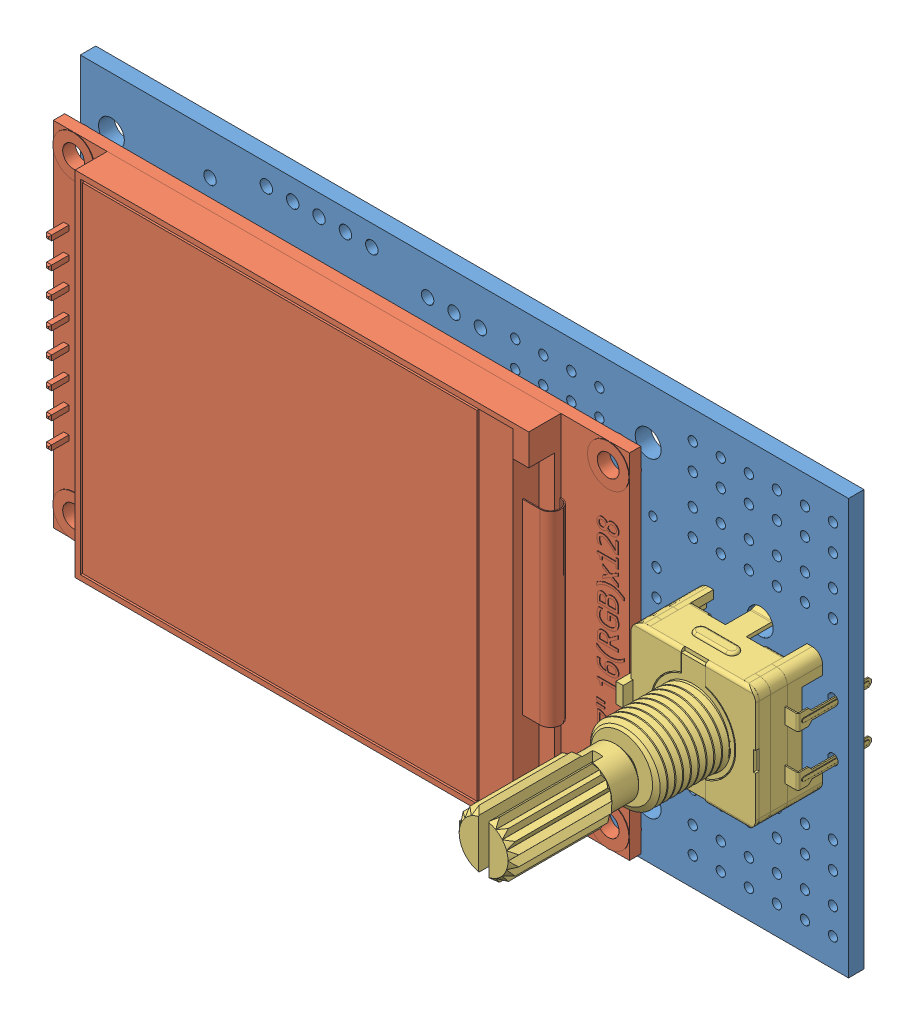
SolidWorks assembly PCB.sldasm, configuration Default (file format 4400). Lengths in mm.
Overall size (74 40 32.1).
5 component instances, 3 part files, 0 mates.
Components (placement in the parent):
- Board-1: Board.sldprt [Default] at (0 0 -1.4914) size (74 40 1.49)
- LCD1-1: LCD1.sldasm [Default] at origin size (55.5 34 12.3)
  - LCD-1e77-TFT-160x128-1: LCD-1e77-TFT-160x128.sldprt [Default] at (28.9004 20.0001 3.2) x (0 -1 0) z (0 0 -1) size (34 55.5 12.3)
- SW1-1: SW1.sldasm [Default] at origin size (15.27 13.1 30.08)
  - EC11_Rotary_Encoder_Switched-1: EC11_Rotary_Encoder_Switched.sldprt [Default] at (65.5001 19.9999 0) x (0 -1 0) z (0 0 1) size (13.1 15.27 30.08)
